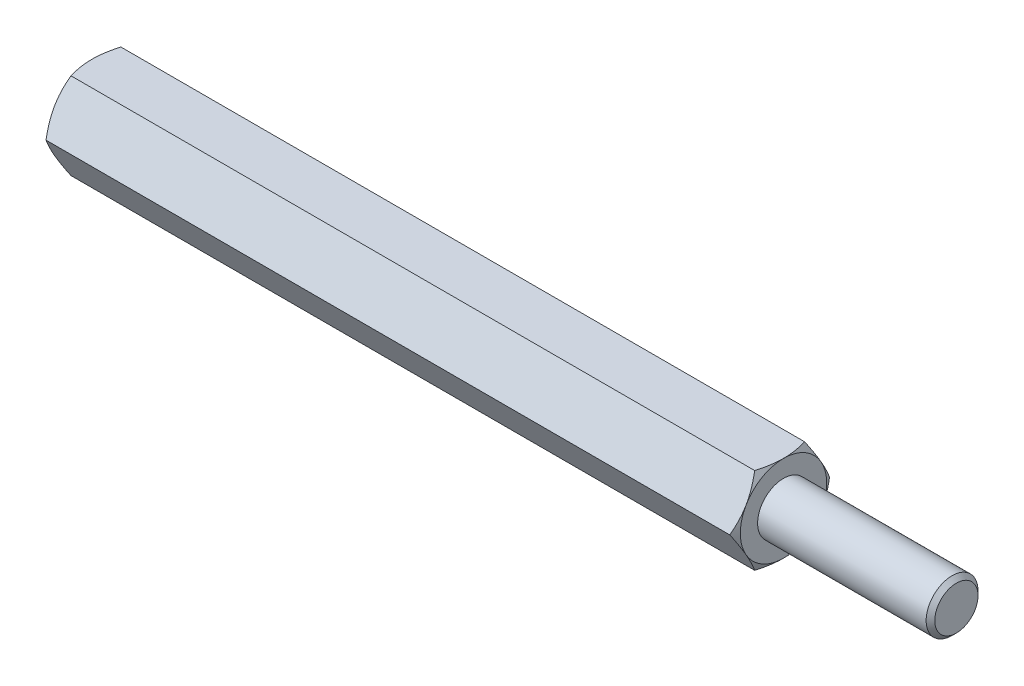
from build123d import *

# Parameters (mm, degrees)
EXTRUDE2_DEPTH = 20
SKETCH3_R      = 1.25
EXTRUDE3_DEPTH = 10
SKETCH5_R      = 1.5
EXTRUDE4_DEPTH = 10
CHAMFER1_SIZE  = 0.25


with BuildPart() as part:
    # Sketch1 → Extrude2 (new, symmetric)
    with BuildSketch(Plane(origin=(0, 0, 0), x_dir=(0, 0, -1), z_dir=(1, 0, 0))):
        Polygon((1.443375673, 2.5), (-1.443375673, 2.5), (-2.886751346, 0), (-1.443375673, -2.5), (1.443375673, -2.5), (2.886751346, 0), align=None)
    extrude(amount=EXTRUDE2_DEPTH, both=True)

    # Sketch2 → Cut-Revolve1 (revolve, cut)
    with BuildSketch(Plane.XY):
        with BuildLine():
            Line((-20, 2.5), (-18.5, 5.098076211))
            ThreePointArc((-18.5, 5.098076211), (-18.98810136, 6.276457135), (-20, 5.5))
            Line((-20, 5.5), (-20, 2.5))
        make_face()
    cut_revolve1 = revolve(axis=Axis((0, 0, 0), (1, 0, 0)), mode=Mode.SUBTRACT)

    # Mirror1: Cut-Revolve1 across plane
    add(cut_revolve1.mirror(Plane(origin=(0, 0, 0), x_dir=(0, 0, 1), z_dir=(1, 0, 0))), mode=Mode.SUBTRACT)

    # Sketch3 → Extrude3 (cut)
    with BuildSketch(Plane.ZY.offset(20)):
        Circle(SKETCH3_R)
    extrude(amount=-EXTRUDE3_DEPTH, mode=Mode.SUBTRACT)

    # Sketch4 → Cut-Revolve2 (revolve, cut)
    with BuildSketch(Plane.XY, mode=Mode.PRIVATE) as cut_revolve2_sk:
        Polygon((-10, 0), (-10, 1.25), (-9.278312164, 0), align=None)
    revolve(cut_revolve2_sk.sketch.rotate(Axis((-9.278312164, 0, 0), (-1, 0, 0)), 270), axis=Axis((-9.278312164, 0, 0), (-1, 0, 0)), mode=Mode.SUBTRACT)

    # Sketch5 → Extrude4 (add)
    with BuildSketch(Plane(origin=(20, 0, 0), x_dir=(0, 0, -1), z_dir=(1, 0, 0))):
        Circle(SKETCH5_R)
    extrude(amount=EXTRUDE4_DEPTH)

    # Chamfer1
    chamfer1_edges = [part.edges().sort_by_distance(p)[0] for p in [
        (30, 0, 1.5),
    ]]
    chamfer(chamfer1_edges, length=CHAMFER1_SIZE)


solid = part.part
